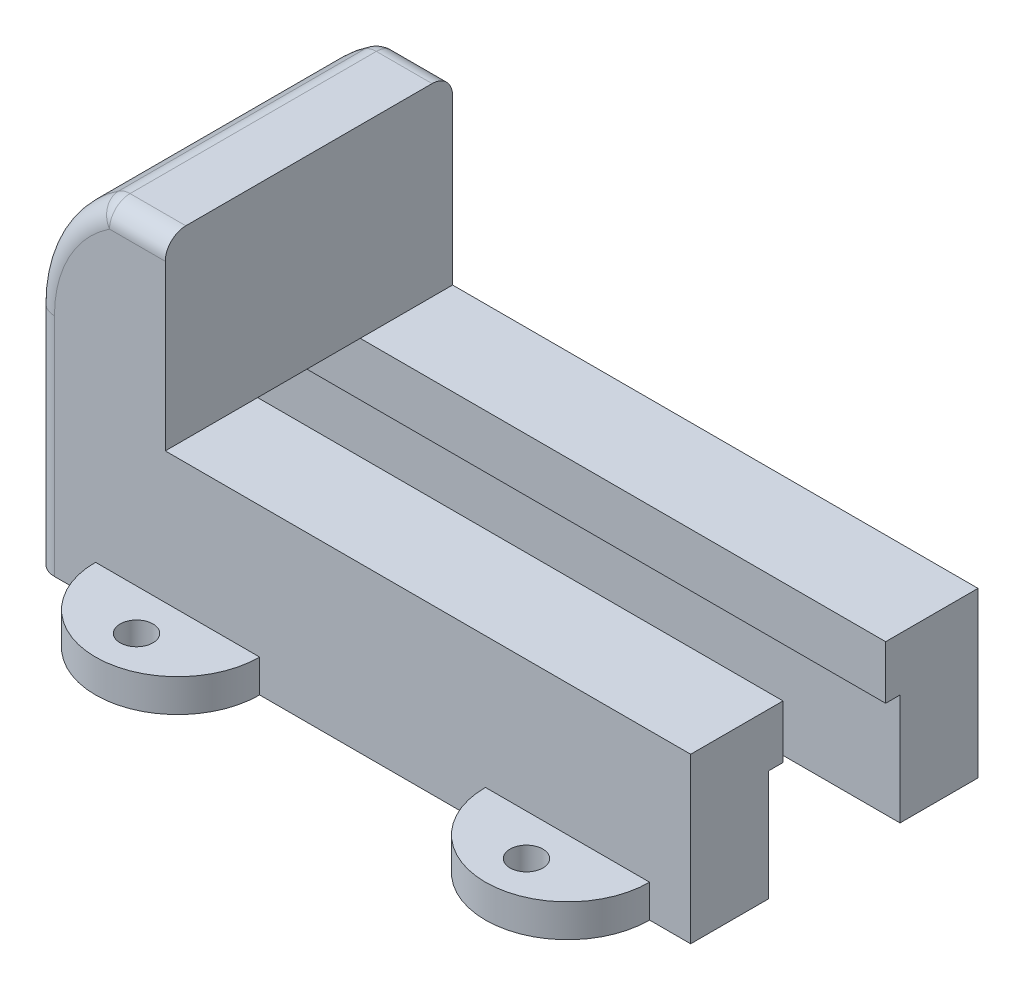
ISO-10303-21;
HEADER;
FILE_DESCRIPTION(('STEP AP214'),'2;1');
FILE_NAME('part.step','',(''),(''),'','','');
FILE_SCHEMA(('AUTOMOTIVE_DESIGN { 1 0 10303 214 1 1 1 1 }'));
ENDSEC;
DATA;
#1=APPLICATION_CONTEXT('core data for automotive mechanical design processes');
#2=APPLICATION_PROTOCOL_DEFINITION('international standard','automotive_design',2000,#1);
#3=PRODUCT_CONTEXT('',#1,'mechanical');
#4=PRODUCT('Part','Part','',(#3));
#5=PRODUCT_RELATED_PRODUCT_CATEGORY('part','',(#4));
#6=PRODUCT_DEFINITION_FORMATION('','',#4);
#7=PRODUCT_DEFINITION_CONTEXT('part definition',#1,'design');
#8=PRODUCT_DEFINITION('design','',#6,#7);
#9=PRODUCT_DEFINITION_SHAPE('','',#8);
#10=(LENGTH_UNIT() NAMED_UNIT(*) SI_UNIT(.MILLI.,.METRE.));
#11=(NAMED_UNIT(*) PLANE_ANGLE_UNIT() SI_UNIT($,.RADIAN.));
#12=(NAMED_UNIT(*) SI_UNIT($,.STERADIAN.) SOLID_ANGLE_UNIT());
#13=UNCERTAINTY_MEASURE_WITH_UNIT(LENGTH_MEASURE(1.E-05),#10,'distance_accuracy_value','');
#14=(GEOMETRIC_REPRESENTATION_CONTEXT(3) GLOBAL_UNCERTAINTY_ASSIGNED_CONTEXT((#13)) GLOBAL_UNIT_ASSIGNED_CONTEXT((#10,
#11,#12)) REPRESENTATION_CONTEXT('',''));
#15=CARTESIAN_POINT('',(0.,0.,0.));
#16=DIRECTION('',(0.,0.,1.));
#17=DIRECTION('',(1.,0.,0.));
#18=AXIS2_PLACEMENT_3D('',#15,#16,#17);
#19=CARTESIAN_POINT('',(0.,40.,-35.));
#20=DIRECTION('',(0.,0.,-1.));
#21=DIRECTION('',(-1.,0.,0.));
#22=AXIS2_PLACEMENT_3D('',#19,#20,#21);
#23=PLANE('',#22);
#24=DIRECTION('',(-1.,0.,0.));
#25=VECTOR('',#24,1.);
#26=CARTESIAN_POINT('',(0.,40.,-35.));
#27=LINE('',#26,#25);
#28=CARTESIAN_POINT('',(160.,40.,-35.));
#29=VERTEX_POINT('',#28);
#30=CARTESIAN_POINT('',(32.,40.,-35.));
#31=VERTEX_POINT('',#30);
#32=EDGE_CURVE('E494',#29,#31,#27,.T.);
#33=ORIENTED_EDGE('',*,*,#32,.F.);
#34=DIRECTION('',(0.,-1.,0.));
#35=VECTOR('',#34,1.);
#36=CARTESIAN_POINT('',(160.,40.,-35.));
#37=LINE('',#36,#35);
#38=CARTESIAN_POINT('',(160.,0.,-35.));
#39=VERTEX_POINT('',#38);
#40=EDGE_CURVE('E49',#29,#39,#37,.T.);
#41=ORIENTED_EDGE('',*,*,#40,.T.);
#42=DIRECTION('',(1.,0.,0.));
#43=VECTOR('',#42,1.);
#44=CARTESIAN_POINT('',(0.,0.,-35.));
#45=LINE('',#44,#43);
#46=CARTESIAN_POINT('',(150.,0.,-35.));
#47=VERTEX_POINT('',#46);
#48=EDGE_CURVE('E399',#47,#39,#45,.T.);
#49=ORIENTED_EDGE('',*,*,#48,.F.);
#50=DIRECTION('',(0.,-1.,0.));
#51=VECTOR('',#50,1.);
#52=CARTESIAN_POINT('',(150.,52.7213595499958,-35.));
#53=LINE('',#52,#51);
#54=CARTESIAN_POINT('',(150.,8.,-35.));
#55=VERTEX_POINT('',#54);
#56=EDGE_CURVE('E301',#55,#47,#53,.T.);
#57=ORIENTED_EDGE('',*,*,#56,.F.);
#58=DIRECTION('',(1.,0.,0.));
#59=VECTOR('',#58,1.);
#60=CARTESIAN_POINT('',(110.,8.,-35.));
#61=LINE('',#60,#59);
#62=CARTESIAN_POINT('',(110.,8.,-35.));
#63=VERTEX_POINT('',#62);
#64=EDGE_CURVE('E309',#63,#55,#61,.T.);
#65=ORIENTED_EDGE('',*,*,#64,.F.);
#66=DIRECTION('',(0.,-1.,0.));
#67=VECTOR('',#66,1.);
#68=CARTESIAN_POINT('',(110.,52.7213595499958,-35.));
#69=LINE('',#68,#67);
#70=CARTESIAN_POINT('',(110.,0.,-35.));
#71=VERTEX_POINT('',#70);
#72=EDGE_CURVE('E304',#63,#71,#69,.T.);
#73=ORIENTED_EDGE('',*,*,#72,.T.);
#74=CARTESIAN_POINT('',(55.,0.,-35.));
#75=VERTEX_POINT('',#74);
#76=EDGE_CURVE('E499',#75,#71,#45,.T.);
#77=ORIENTED_EDGE('',*,*,#76,.F.);
#78=DIRECTION('',(0.,-1.,0.));
#79=VECTOR('',#78,1.);
#80=CARTESIAN_POINT('',(55.,8.,-35.));
#81=LINE('',#80,#79);
#82=CARTESIAN_POINT('',(55.,8.,-35.));
#83=VERTEX_POINT('',#82);
#84=EDGE_CURVE('E320',#83,#75,#81,.T.);
#85=ORIENTED_EDGE('',*,*,#84,.F.);
#86=DIRECTION('',(1.,0.,0.));
#87=VECTOR('',#86,1.);
#88=CARTESIAN_POINT('',(15.,8.,-35.));
#89=LINE('',#88,#87);
#90=CARTESIAN_POINT('',(15.,8.,-35.));
#91=VERTEX_POINT('',#90);
#92=EDGE_CURVE('E318',#91,#83,#89,.T.);
#93=ORIENTED_EDGE('',*,*,#92,.F.);
#94=DIRECTION('',(0.,-1.,0.));
#95=VECTOR('',#94,1.);
#96=CARTESIAN_POINT('',(15.,8.,-35.));
#97=LINE('',#96,#95);
#98=CARTESIAN_POINT('',(15.,0.,-35.));
#99=VERTEX_POINT('',#98);
#100=EDGE_CURVE('E323',#91,#99,#97,.T.);
#101=ORIENTED_EDGE('',*,*,#100,.T.);
#102=CARTESIAN_POINT('',(5.,0.,-35.));
#103=VERTEX_POINT('',#102);
#104=EDGE_CURVE('E495',#103,#99,#45,.T.);
#105=ORIENTED_EDGE('',*,*,#104,.F.);
#106=DIRECTION('',(0.,-1.,0.));
#107=VECTOR('',#106,1.);
#108=CARTESIAN_POINT('',(5.,55.,-35.));
#109=LINE('',#108,#107);
#110=CARTESIAN_POINT('',(5.,55.,-35.));
#111=VERTEX_POINT('',#110);
#112=EDGE_CURVE('E426',#103,#111,#109,.F.);
#113=ORIENTED_EDGE('',*,*,#112,.T.);
#114=CARTESIAN_POINT('',(35.,55.,-35.));
#115=DIRECTION('',(0.,0.,-1.));
#116=DIRECTION('',(-1.,0.,0.));
#117=AXIS2_PLACEMENT_3D('',#114,#115,#116);
#118=CIRCLE('',#117,30.);
#119=CARTESIAN_POINT('',(18.416876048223,80.,-35.));
#120=VERTEX_POINT('',#119);
#121=EDGE_CURVE('E428',#111,#120,#118,.T.);
#122=ORIENTED_EDGE('',*,*,#121,.T.);
#123=DIRECTION('',(-1.,0.,0.));
#124=VECTOR('',#123,1.);
#125=CARTESIAN_POINT('',(0.,80.,-35.));
#126=LINE('',#125,#124);
#127=CARTESIAN_POINT('',(32.,80.,-35.));
#128=VERTEX_POINT('',#127);
#129=EDGE_CURVE('E430',#120,#128,#126,.F.);
#130=ORIENTED_EDGE('',*,*,#129,.T.);
#131=DIRECTION('',(0.,1.,0.));
#132=VECTOR('',#131,1.);
#133=CARTESIAN_POINT('',(32.,40.,-35.));
#134=LINE('',#133,#132);
#135=EDGE_CURVE('E416',#31,#128,#134,.T.);
#136=ORIENTED_EDGE('',*,*,#135,.F.);
#137=EDGE_LOOP('',(#33,#41,#49,#57,#65,#73,#77,#85,#93,#101,#105,#113,#122,#130,#136));
#138=FACE_BOUND('',#137,.T.);
#139=ADVANCED_FACE('F32',(#138),#23,.T.);
#140=CARTESIAN_POINT('',(0.,0.,35.));
#141=DIRECTION('',(0.,1.,0.));
#142=DIRECTION('',(0.,0.,1.));
#143=AXIS2_PLACEMENT_3D('',#140,#141,#142);
#144=PLANE('',#143);
#145=CARTESIAN_POINT('',(130.,0.,-45.));
#146=DIRECTION('',(0.,1.,0.));
#147=DIRECTION('',(0.,0.,1.));
#148=AXIS2_PLACEMENT_3D('',#145,#146,#147);
#149=CIRCLE('',#148,4.);
#150=CARTESIAN_POINT('',(130.,0.,-41.));
#151=VERTEX_POINT('',#150);
#152=EDGE_CURVE('E295',#151,#151,#149,.T.);
#153=ORIENTED_EDGE('',*,*,#152,.T.);
#154=EDGE_LOOP('',(#153));
#155=FACE_BOUND('',#154,.T.);
#156=CARTESIAN_POINT('',(35.,0.,-45.));
#157=DIRECTION('',(0.,1.,0.));
#158=DIRECTION('',(0.,0.,1.));
#159=AXIS2_PLACEMENT_3D('',#156,#157,#158);
#160=CIRCLE('',#159,4.);
#161=CARTESIAN_POINT('',(35.,0.,-41.));
#162=VERTEX_POINT('',#161);
#163=EDGE_CURVE('E289',#162,#162,#160,.T.);
#164=ORIENTED_EDGE('',*,*,#163,.T.);
#165=EDGE_LOOP('',(#164));
#166=FACE_BOUND('',#165,.T.);
#167=DIRECTION('',(0.,0.,-1.));
#168=VECTOR('',#167,1.);
#169=CARTESIAN_POINT('',(160.,0.,35.));
#170=LINE('',#169,#168);
#171=CARTESIAN_POINT('',(160.,0.,-16.));
#172=VERTEX_POINT('',#171);
#173=EDGE_CURVE('E272',#172,#39,#170,.T.);
#174=ORIENTED_EDGE('',*,*,#173,.F.);
#175=DIRECTION('',(1.,0.,0.));
#176=VECTOR('',#175,1.);
#177=CARTESIAN_POINT('',(0.,0.,-16.));
#178=LINE('',#177,#176);
#179=CARTESIAN_POINT('',(0.,0.,-16.));
#180=VERTEX_POINT('',#179);
#181=EDGE_CURVE('E384',#180,#172,#178,.T.);
#182=ORIENTED_EDGE('',*,*,#181,.F.);
#183=DIRECTION('',(0.,0.,-1.));
#184=VECTOR('',#183,1.);
#185=CARTESIAN_POINT('',(0.,0.,35.));
#186=LINE('',#185,#184);
#187=CARTESIAN_POINT('',(0.,0.,-30.));
#188=VERTEX_POINT('',#187);
#189=EDGE_CURVE('E492',#180,#188,#186,.T.);
#190=ORIENTED_EDGE('',*,*,#189,.T.);
#191=CARTESIAN_POINT('',(5.,0.,-30.));
#192=DIRECTION('',(0.,1.,0.));
#193=DIRECTION('',(0.,0.,1.));
#194=AXIS2_PLACEMENT_3D('',#191,#192,#193);
#195=CIRCLE('',#194,5.);
#196=EDGE_CURVE('E41',#188,#103,#195,.F.);
#197=ORIENTED_EDGE('',*,*,#196,.T.);
#198=ORIENTED_EDGE('',*,*,#104,.T.);
#199=CARTESIAN_POINT('',(35.,0.,-35.));
#200=DIRECTION('',(0.,1.,0.));
#201=DIRECTION('',(0.,0.,-1.));
#202=AXIS2_PLACEMENT_3D('',#199,#200,#201);
#203=CIRCLE('',#202,20.);
#204=EDGE_CURVE('E308',#75,#99,#203,.T.);
#205=ORIENTED_EDGE('',*,*,#204,.F.);
#206=ORIENTED_EDGE('',*,*,#76,.T.);
#207=CARTESIAN_POINT('',(130.,0.,-35.));
#208=DIRECTION('',(0.,1.,0.));
#209=DIRECTION('',(0.,0.,-1.));
#210=AXIS2_PLACEMENT_3D('',#207,#208,#209);
#211=CIRCLE('',#210,20.);
#212=EDGE_CURVE('E302',#47,#71,#211,.T.);
#213=ORIENTED_EDGE('',*,*,#212,.F.);
#214=ORIENTED_EDGE('',*,*,#48,.T.);
#215=EDGE_LOOP('',(#174,#182,#190,#197,#198,#205,#206,#213,#214));
#216=FACE_BOUND('',#215,.T.);
#217=ADVANCED_FACE('F543',(#155,#166,#216),#144,.F.);
#218=CARTESIAN_POINT('',(130.,0.,45.));
#219=DIRECTION('',(0.,1.,0.));
#220=DIRECTION('',(0.,0.,1.));
#221=AXIS2_PLACEMENT_3D('',#218,#219,#220);
#222=CIRCLE('',#221,4.);
#223=CARTESIAN_POINT('',(130.,0.,49.));
#224=VERTEX_POINT('',#223);
#225=EDGE_CURVE('E283',#224,#224,#222,.T.);
#226=ORIENTED_EDGE('',*,*,#225,.T.);
#227=EDGE_LOOP('',(#226));
#228=FACE_BOUND('',#227,.T.);
#229=CARTESIAN_POINT('',(35.,0.,45.));
#230=DIRECTION('',(0.,1.,0.));
#231=DIRECTION('',(0.,0.,1.));
#232=AXIS2_PLACEMENT_3D('',#229,#230,#231);
#233=CIRCLE('',#232,4.);
#234=CARTESIAN_POINT('',(35.,0.,49.));
#235=VERTEX_POINT('',#234);
#236=EDGE_CURVE('E277',#235,#235,#233,.T.);
#237=ORIENTED_EDGE('',*,*,#236,.T.);
#238=EDGE_LOOP('',(#237));
#239=FACE_BOUND('',#238,.T.);
#240=DIRECTION('',(0.,0.,-1.));
#241=VECTOR('',#240,1.);
#242=CARTESIAN_POINT('',(160.,0.,35.));
#243=LINE('',#242,#241);
#244=CARTESIAN_POINT('',(160.,0.,35.));
#245=VERTEX_POINT('',#244);
#246=CARTESIAN_POINT('',(160.,0.,16.));
#247=VERTEX_POINT('',#246);
#248=EDGE_CURVE('E57',#245,#247,#243,.T.);
#249=ORIENTED_EDGE('',*,*,#248,.F.);
#250=DIRECTION('',(1.,0.,0.));
#251=VECTOR('',#250,1.);
#252=CARTESIAN_POINT('',(0.,0.,35.));
#253=LINE('',#252,#251);
#254=CARTESIAN_POINT('',(150.,0.,35.));
#255=VERTEX_POINT('',#254);
#256=EDGE_CURVE('E491',#255,#245,#253,.T.);
#257=ORIENTED_EDGE('',*,*,#256,.F.);
#258=CARTESIAN_POINT('',(130.,0.,35.));
#259=DIRECTION('',(0.,-1.,0.));
#260=DIRECTION('',(0.,0.,1.));
#261=AXIS2_PLACEMENT_3D('',#258,#259,#260);
#262=CIRCLE('',#261,20.);
#263=CARTESIAN_POINT('',(110.,0.,35.));
#264=VERTEX_POINT('',#263);
#265=EDGE_CURVE('E326',#255,#264,#262,.T.);
#266=ORIENTED_EDGE('',*,*,#265,.T.);
#267=CARTESIAN_POINT('',(55.,0.,35.));
#268=VERTEX_POINT('',#267);
#269=EDGE_CURVE('E490',#268,#264,#253,.T.);
#270=ORIENTED_EDGE('',*,*,#269,.F.);
#271=CARTESIAN_POINT('',(35.,0.,35.));
#272=DIRECTION('',(0.,-1.,0.));
#273=DIRECTION('',(0.,0.,1.));
#274=AXIS2_PLACEMENT_3D('',#271,#272,#273);
#275=CIRCLE('',#274,20.);
#276=CARTESIAN_POINT('',(15.,0.,35.));
#277=VERTEX_POINT('',#276);
#278=EDGE_CURVE('E341',#268,#277,#275,.T.);
#279=ORIENTED_EDGE('',*,*,#278,.T.);
#280=CARTESIAN_POINT('',(5.,0.,35.));
#281=VERTEX_POINT('',#280);
#282=EDGE_CURVE('E406',#281,#277,#253,.T.);
#283=ORIENTED_EDGE('',*,*,#282,.F.);
#284=CARTESIAN_POINT('',(5.,0.,30.));
#285=DIRECTION('',(0.,1.,0.));
#286=DIRECTION('',(0.,0.,1.));
#287=AXIS2_PLACEMENT_3D('',#284,#285,#286);
#288=CIRCLE('',#287,5.);
#289=CARTESIAN_POINT('',(0.,0.,30.));
#290=VERTEX_POINT('',#289);
#291=EDGE_CURVE('E11',#281,#290,#288,.F.);
#292=ORIENTED_EDGE('',*,*,#291,.T.);
#293=CARTESIAN_POINT('',(0.,0.,16.));
#294=VERTEX_POINT('',#293);
#295=EDGE_CURVE('E421',#290,#294,#186,.T.);
#296=ORIENTED_EDGE('',*,*,#295,.T.);
#297=DIRECTION('',(1.,0.,0.));
#298=VECTOR('',#297,1.);
#299=CARTESIAN_POINT('',(0.,0.,16.));
#300=LINE('',#299,#298);
#301=EDGE_CURVE('E386',#294,#247,#300,.T.);
#302=ORIENTED_EDGE('',*,*,#301,.T.);
#303=EDGE_LOOP('',(#249,#257,#266,#270,#279,#283,#292,#296,#302));
#304=FACE_BOUND('',#303,.T.);
#305=ADVANCED_FACE('F487',(#228,#239,#304),#144,.F.);
#306=CARTESIAN_POINT('',(0.,40.,35.));
#307=DIRECTION('',(0.,0.,-1.));
#308=DIRECTION('',(-1.,0.,0.));
#309=AXIS2_PLACEMENT_3D('',#306,#307,#308);
#310=PLANE('',#309);
#311=DIRECTION('',(0.,-1.,0.));
#312=VECTOR('',#311,1.);
#313=CARTESIAN_POINT('',(160.,40.,35.));
#314=LINE('',#313,#312);
#315=CARTESIAN_POINT('',(160.,40.,35.));
#316=VERTEX_POINT('',#315);
#317=EDGE_CURVE('E261',#316,#245,#314,.T.);
#318=ORIENTED_EDGE('',*,*,#317,.F.);
#319=DIRECTION('',(-1.,0.,0.));
#320=VECTOR('',#319,1.);
#321=CARTESIAN_POINT('',(0.,40.,35.));
#322=LINE('',#321,#320);
#323=CARTESIAN_POINT('',(32.,40.,35.));
#324=VERTEX_POINT('',#323);
#325=EDGE_CURVE('E235',#316,#324,#322,.T.);
#326=ORIENTED_EDGE('',*,*,#325,.T.);
#327=DIRECTION('',(0.,1.,0.));
#328=VECTOR('',#327,1.);
#329=CARTESIAN_POINT('',(32.,40.,35.));
#330=LINE('',#329,#328);
#331=CARTESIAN_POINT('',(32.,80.,35.));
#332=VERTEX_POINT('',#331);
#333=EDGE_CURVE('E239',#324,#332,#330,.T.);
#334=ORIENTED_EDGE('',*,*,#333,.T.);
#335=DIRECTION('',(-1.,0.,0.));
#336=VECTOR('',#335,1.);
#337=CARTESIAN_POINT('',(16.97224362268,80.,35.));
#338=LINE('',#337,#336);
#339=CARTESIAN_POINT('',(18.416876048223,80.,35.));
#340=VERTEX_POINT('',#339);
#341=EDGE_CURVE('E436',#332,#340,#338,.T.);
#342=ORIENTED_EDGE('',*,*,#341,.T.);
#343=CARTESIAN_POINT('',(35.,55.,35.));
#344=DIRECTION('',(0.,0.,-1.));
#345=DIRECTION('',(-1.,0.,0.));
#346=AXIS2_PLACEMENT_3D('',#343,#344,#345);
#347=CIRCLE('',#346,30.);
#348=CARTESIAN_POINT('',(5.,55.,35.));
#349=VERTEX_POINT('',#348);
#350=EDGE_CURVE('E434',#340,#349,#347,.F.);
#351=ORIENTED_EDGE('',*,*,#350,.T.);
#352=DIRECTION('',(0.,-1.,0.));
#353=VECTOR('',#352,1.);
#354=CARTESIAN_POINT('',(5.,40.,35.));
#355=LINE('',#354,#353);
#356=EDGE_CURVE('E432',#349,#281,#355,.T.);
#357=ORIENTED_EDGE('',*,*,#356,.T.);
#358=ORIENTED_EDGE('',*,*,#282,.T.);
#359=DIRECTION('',(0.,-1.,0.));
#360=VECTOR('',#359,1.);
#361=CARTESIAN_POINT('',(15.,8.,35.));
#362=LINE('',#361,#360);
#363=CARTESIAN_POINT('',(15.,8.,35.));
#364=VERTEX_POINT('',#363);
#365=EDGE_CURVE('E347',#364,#277,#362,.T.);
#366=ORIENTED_EDGE('',*,*,#365,.F.);
#367=DIRECTION('',(1.,0.,0.));
#368=VECTOR('',#367,1.);
#369=CARTESIAN_POINT('',(15.,8.,35.));
#370=LINE('',#369,#368);
#371=CARTESIAN_POINT('',(55.,8.,35.));
#372=VERTEX_POINT('',#371);
#373=EDGE_CURVE('E345',#364,#372,#370,.T.);
#374=ORIENTED_EDGE('',*,*,#373,.T.);
#375=DIRECTION('',(0.,-1.,0.));
#376=VECTOR('',#375,1.);
#377=CARTESIAN_POINT('',(55.,8.,35.));
#378=LINE('',#377,#376);
#379=EDGE_CURVE('E350',#372,#268,#378,.T.);
#380=ORIENTED_EDGE('',*,*,#379,.T.);
#381=ORIENTED_EDGE('',*,*,#269,.T.);
#382=DIRECTION('',(0.,-1.,0.));
#383=VECTOR('',#382,1.);
#384=CARTESIAN_POINT('',(110.,52.7213595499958,35.));
#385=LINE('',#384,#383);
#386=CARTESIAN_POINT('',(110.,8.,35.));
#387=VERTEX_POINT('',#386);
#388=EDGE_CURVE('E337',#387,#264,#385,.T.);
#389=ORIENTED_EDGE('',*,*,#388,.F.);
#390=DIRECTION('',(1.,0.,0.));
#391=VECTOR('',#390,1.);
#392=CARTESIAN_POINT('',(110.,8.,35.));
#393=LINE('',#392,#391);
#394=CARTESIAN_POINT('',(150.,8.,35.));
#395=VERTEX_POINT('',#394);
#396=EDGE_CURVE('E331',#387,#395,#393,.T.);
#397=ORIENTED_EDGE('',*,*,#396,.T.);
#398=DIRECTION('',(0.,-1.,0.));
#399=VECTOR('',#398,1.);
#400=CARTESIAN_POINT('',(150.,52.7213595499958,35.));
#401=LINE('',#400,#399);
#402=EDGE_CURVE('E334',#395,#255,#401,.T.);
#403=ORIENTED_EDGE('',*,*,#402,.T.);
#404=ORIENTED_EDGE('',*,*,#256,.T.);
#405=EDGE_LOOP('',(#318,#326,#334,#342,#351,#357,#358,#366,#374,#380,#381,#389,#397,#403,#404));
#406=FACE_BOUND('',#405,.T.);
#407=ADVANCED_FACE('F486',(#406),#310,.F.);
#408=CARTESIAN_POINT('',(0.,27.,-12.5));
#409=DIRECTION('',(0.,0.,-1.));
#410=DIRECTION('',(-1.,0.,0.));
#411=AXIS2_PLACEMENT_3D('',#408,#409,#410);
#412=PLANE('',#411);
#413=DIRECTION('',(0.,-1.,0.));
#414=VECTOR('',#413,1.);
#415=CARTESIAN_POINT('',(160.,27.,-12.5));
#416=LINE('',#415,#414);
#417=CARTESIAN_POINT('',(160.,40.,-12.5));
#418=VERTEX_POINT('',#417);
#419=CARTESIAN_POINT('',(160.,27.,-12.5));
#420=VERTEX_POINT('',#419);
#421=EDGE_CURVE('E269',#418,#420,#416,.T.);
#422=ORIENTED_EDGE('',*,*,#421,.F.);
#423=DIRECTION('',(1.,0.,0.));
#424=VECTOR('',#423,1.);
#425=CARTESIAN_POINT('',(0.,40.,-12.5));
#426=LINE('',#425,#424);
#427=CARTESIAN_POINT('',(32.,40.,-12.5));
#428=VERTEX_POINT('',#427);
#429=EDGE_CURVE('E376',#428,#418,#426,.T.);
#430=ORIENTED_EDGE('',*,*,#429,.F.);
#431=CARTESIAN_POINT('',(0.,40.,-12.5));
#432=VERTEX_POINT('',#431);
#433=EDGE_CURVE('E249',#432,#428,#426,.T.);
#434=ORIENTED_EDGE('',*,*,#433,.F.);
#435=DIRECTION('',(0.,1.,0.));
#436=VECTOR('',#435,1.);
#437=CARTESIAN_POINT('',(0.,27.,-12.5));
#438=LINE('',#437,#436);
#439=CARTESIAN_POINT('',(0.,27.,-12.5));
#440=VERTEX_POINT('',#439);
#441=EDGE_CURVE('E353',#440,#432,#438,.T.);
#442=ORIENTED_EDGE('',*,*,#441,.F.);
#443=DIRECTION('',(1.,0.,0.));
#444=VECTOR('',#443,1.);
#445=CARTESIAN_POINT('',(0.,27.,-12.5));
#446=LINE('',#445,#444);
#447=EDGE_CURVE('E377',#440,#420,#446,.T.);
#448=ORIENTED_EDGE('',*,*,#447,.T.);
#449=EDGE_LOOP('',(#422,#430,#434,#442,#448));
#450=FACE_BOUND('',#449,.T.);
#451=ADVANCED_FACE('F640',(#450),#412,.F.);
#452=CARTESIAN_POINT('',(0.,27.,-12.5));
#453=DIRECTION('',(0.,1.,0.));
#454=DIRECTION('',(0.,0.,1.));
#455=AXIS2_PLACEMENT_3D('',#452,#453,#454);
#456=PLANE('',#455);
#457=DIRECTION('',(0.,0.,-1.));
#458=VECTOR('',#457,1.);
#459=CARTESIAN_POINT('',(160.,27.,-12.5));
#460=LINE('',#459,#458);
#461=CARTESIAN_POINT('',(160.,27.,-16.));
#462=VERTEX_POINT('',#461);
#463=EDGE_CURVE('E266',#420,#462,#460,.T.);
#464=ORIENTED_EDGE('',*,*,#463,.F.);
#465=ORIENTED_EDGE('',*,*,#447,.F.);
#466=DIRECTION('',(0.,0.,1.));
#467=VECTOR('',#466,1.);
#468=CARTESIAN_POINT('',(0.,27.,-12.5));
#469=LINE('',#468,#467);
#470=CARTESIAN_POINT('',(0.,27.,-16.));
#471=VERTEX_POINT('',#470);
#472=EDGE_CURVE('E373',#471,#440,#469,.T.);
#473=ORIENTED_EDGE('',*,*,#472,.F.);
#474=DIRECTION('',(1.,0.,0.));
#475=VECTOR('',#474,1.);
#476=CARTESIAN_POINT('',(0.,27.,-16.));
#477=LINE('',#476,#475);
#478=EDGE_CURVE('E381',#471,#462,#477,.T.);
#479=ORIENTED_EDGE('',*,*,#478,.T.);
#480=EDGE_LOOP('',(#464,#465,#473,#479));
#481=FACE_BOUND('',#480,.T.);
#482=ADVANCED_FACE('F650',(#481),#456,.F.);
#483=CARTESIAN_POINT('',(0.,27.,-16.));
#484=DIRECTION('',(0.,0.,-1.));
#485=DIRECTION('',(0.,1.,0.));
#486=AXIS2_PLACEMENT_3D('',#483,#484,#485);
#487=PLANE('',#486);
#488=DIRECTION('',(0.,-1.,0.));
#489=VECTOR('',#488,1.);
#490=CARTESIAN_POINT('',(160.,27.,-16.));
#491=LINE('',#490,#489);
#492=EDGE_CURVE('E263',#462,#172,#491,.T.);
#493=ORIENTED_EDGE('',*,*,#492,.F.);
#494=ORIENTED_EDGE('',*,*,#478,.F.);
#495=DIRECTION('',(0.,1.,0.));
#496=VECTOR('',#495,1.);
#497=CARTESIAN_POINT('',(0.,27.,-16.));
#498=LINE('',#497,#496);
#499=EDGE_CURVE('E370',#180,#471,#498,.T.);
#500=ORIENTED_EDGE('',*,*,#499,.F.);
#501=ORIENTED_EDGE('',*,*,#181,.T.);
#502=EDGE_LOOP('',(#493,#494,#500,#501));
#503=FACE_BOUND('',#502,.T.);
#504=ADVANCED_FACE('F661',(#503),#487,.F.);
#505=CARTESIAN_POINT('',(0.,0.,16.));
#506=DIRECTION('',(0.,0.,1.));
#507=DIRECTION('',(0.,-1.,0.));
#508=AXIS2_PLACEMENT_3D('',#505,#506,#507);
#509=PLANE('',#508);
#510=DIRECTION('',(0.,1.,0.));
#511=VECTOR('',#510,1.);
#512=CARTESIAN_POINT('',(160.,0.,16.));
#513=LINE('',#512,#511);
#514=CARTESIAN_POINT('',(160.,27.,16.));
#515=VERTEX_POINT('',#514);
#516=EDGE_CURVE('E256',#247,#515,#513,.T.);
#517=ORIENTED_EDGE('',*,*,#516,.F.);
#518=ORIENTED_EDGE('',*,*,#301,.F.);
#519=DIRECTION('',(0.,-1.,0.));
#520=VECTOR('',#519,1.);
#521=CARTESIAN_POINT('',(0.,0.,16.));
#522=LINE('',#521,#520);
#523=CARTESIAN_POINT('',(0.,27.,16.));
#524=VERTEX_POINT('',#523);
#525=EDGE_CURVE('E367',#524,#294,#522,.T.);
#526=ORIENTED_EDGE('',*,*,#525,.F.);
#527=DIRECTION('',(1.,0.,0.));
#528=VECTOR('',#527,1.);
#529=CARTESIAN_POINT('',(0.,27.,16.));
#530=LINE('',#529,#528);
#531=EDGE_CURVE('E388',#524,#515,#530,.T.);
#532=ORIENTED_EDGE('',*,*,#531,.T.);
#533=EDGE_LOOP('',(#517,#518,#526,#532));
#534=FACE_BOUND('',#533,.T.);
#535=ADVANCED_FACE('F671',(#534),#509,.F.);
#536=CARTESIAN_POINT('',(0.,27.,16.));
#537=DIRECTION('',(0.,1.,0.));
#538=DIRECTION('',(0.,0.,1.));
#539=AXIS2_PLACEMENT_3D('',#536,#537,#538);
#540=PLANE('',#539);
#541=DIRECTION('',(0.,0.,-1.));
#542=VECTOR('',#541,1.);
#543=CARTESIAN_POINT('',(160.,27.,16.));
#544=LINE('',#543,#542);
#545=CARTESIAN_POINT('',(160.,27.,12.5));
#546=VERTEX_POINT('',#545);
#547=EDGE_CURVE('E254',#515,#546,#544,.T.);
#548=ORIENTED_EDGE('',*,*,#547,.F.);
#549=ORIENTED_EDGE('',*,*,#531,.F.);
#550=DIRECTION('',(0.,0.,1.));
#551=VECTOR('',#550,1.);
#552=CARTESIAN_POINT('',(0.,27.,16.));
#553=LINE('',#552,#551);
#554=CARTESIAN_POINT('',(0.,27.,12.5));
#555=VERTEX_POINT('',#554);
#556=EDGE_CURVE('E364',#555,#524,#553,.T.);
#557=ORIENTED_EDGE('',*,*,#556,.F.);
#558=DIRECTION('',(1.,0.,0.));
#559=VECTOR('',#558,1.);
#560=CARTESIAN_POINT('',(0.,27.,12.5));
#561=LINE('',#560,#559);
#562=EDGE_CURVE('E391',#555,#546,#561,.T.);
#563=ORIENTED_EDGE('',*,*,#562,.T.);
#564=EDGE_LOOP('',(#548,#549,#557,#563));
#565=FACE_BOUND('',#564,.T.);
#566=ADVANCED_FACE('F681',(#565),#540,.F.);
#567=CARTESIAN_POINT('',(0.,27.,12.5));
#568=DIRECTION('',(0.,0.,1.));
#569=DIRECTION('',(1.,0.,0.));
#570=AXIS2_PLACEMENT_3D('',#567,#568,#569);
#571=PLANE('',#570);
#572=DIRECTION('',(0.,1.,0.));
#573=VECTOR('',#572,1.);
#574=CARTESIAN_POINT('',(160.,27.,12.5));
#575=LINE('',#574,#573);
#576=CARTESIAN_POINT('',(160.,40.,12.5));
#577=VERTEX_POINT('',#576);
#578=EDGE_CURVE('E245',#546,#577,#575,.T.);
#579=ORIENTED_EDGE('',*,*,#578,.F.);
#580=ORIENTED_EDGE('',*,*,#562,.F.);
#581=DIRECTION('',(0.,-1.,0.));
#582=VECTOR('',#581,1.);
#583=CARTESIAN_POINT('',(0.,27.,12.5));
#584=LINE('',#583,#582);
#585=CARTESIAN_POINT('',(0.,40.,12.5));
#586=VERTEX_POINT('',#585);
#587=EDGE_CURVE('E361',#586,#555,#584,.T.);
#588=ORIENTED_EDGE('',*,*,#587,.F.);
#589=DIRECTION('',(1.,0.,0.));
#590=VECTOR('',#589,1.);
#591=CARTESIAN_POINT('',(0.,40.,12.5));
#592=LINE('',#591,#590);
#593=CARTESIAN_POINT('',(32.,40.,12.5));
#594=VERTEX_POINT('',#593);
#595=EDGE_CURVE('E248',#586,#594,#592,.T.);
#596=ORIENTED_EDGE('',*,*,#595,.T.);
#597=EDGE_CURVE('E232',#594,#577,#592,.T.);
#598=ORIENTED_EDGE('',*,*,#597,.T.);
#599=EDGE_LOOP('',(#579,#580,#588,#596,#598));
#600=FACE_BOUND('',#599,.T.);
#601=ADVANCED_FACE('F244',(#600),#571,.F.);
#602=CARTESIAN_POINT('',(0.,40.,35.));
#603=DIRECTION('',(0.,-1.,0.));
#604=DIRECTION('',(0.,0.,-1.));
#605=AXIS2_PLACEMENT_3D('',#602,#603,#604);
#606=PLANE('',#605);
#607=DIRECTION('',(0.,0.,1.));
#608=VECTOR('',#607,1.);
#609=CARTESIAN_POINT('',(32.,40.,-35.));
#610=LINE('',#609,#608);
#611=EDGE_CURVE('E403',#31,#428,#610,.T.);
#612=ORIENTED_EDGE('',*,*,#611,.T.);
#613=ORIENTED_EDGE('',*,*,#429,.T.);
#614=DIRECTION('',(0.,0.,-1.));
#615=VECTOR('',#614,1.);
#616=CARTESIAN_POINT('',(160.,40.,35.));
#617=LINE('',#616,#615);
#618=EDGE_CURVE('E240',#418,#29,#617,.T.);
#619=ORIENTED_EDGE('',*,*,#618,.T.);
#620=ORIENTED_EDGE('',*,*,#32,.T.);
#621=EDGE_LOOP('',(#612,#613,#619,#620));
#622=FACE_BOUND('',#621,.T.);
#623=ADVANCED_FACE('F555',(#622),#606,.F.);
#624=EDGE_CURVE('E229',#316,#577,#617,.T.);
#625=ORIENTED_EDGE('',*,*,#624,.T.);
#626=ORIENTED_EDGE('',*,*,#597,.F.);
#627=EDGE_CURVE('E413',#594,#324,#610,.T.);
#628=ORIENTED_EDGE('',*,*,#627,.T.);
#629=ORIENTED_EDGE('',*,*,#325,.F.);
#630=EDGE_LOOP('',(#625,#626,#628,#629));
#631=FACE_BOUND('',#630,.T.);
#632=ADVANCED_FACE('F231',(#631),#606,.F.);
#633=CARTESIAN_POINT('',(0.,0.,35.));
#634=DIRECTION('',(1.,0.,0.));
#635=DIRECTION('',(0.,0.,-1.));
#636=AXIS2_PLACEMENT_3D('',#633,#634,#635);
#637=PLANE('',#636);
#638=DIRECTION('',(0.,0.,1.));
#639=VECTOR('',#638,1.);
#640=CARTESIAN_POINT('',(0.,55.,-35.));
#641=LINE('',#640,#639);
#642=CARTESIAN_POINT('',(0.,55.,-30.));
#643=VERTEX_POINT('',#642);
#644=CARTESIAN_POINT('',(0.,55.,30.));
#645=VERTEX_POINT('',#644);
#646=EDGE_CURVE('E396',#643,#645,#641,.T.);
#647=ORIENTED_EDGE('',*,*,#646,.F.);
#648=DIRECTION('',(0.,-1.,0.));
#649=VECTOR('',#648,1.);
#650=CARTESIAN_POINT('',(0.,0.,-30.));
#651=LINE('',#650,#649);
#652=EDGE_CURVE('E450',#643,#188,#651,.T.);
#653=ORIENTED_EDGE('',*,*,#652,.T.);
#654=ORIENTED_EDGE('',*,*,#189,.F.);
#655=ORIENTED_EDGE('',*,*,#499,.T.);
#656=ORIENTED_EDGE('',*,*,#472,.T.);
#657=ORIENTED_EDGE('',*,*,#441,.T.);
#658=DIRECTION('',(0.,0.,1.));
#659=VECTOR('',#658,1.);
#660=CARTESIAN_POINT('',(0.,40.,12.5));
#661=LINE('',#660,#659);
#662=EDGE_CURVE('E358',#432,#586,#661,.T.);
#663=ORIENTED_EDGE('',*,*,#662,.T.);
#664=ORIENTED_EDGE('',*,*,#587,.T.);
#665=ORIENTED_EDGE('',*,*,#556,.T.);
#666=ORIENTED_EDGE('',*,*,#525,.T.);
#667=ORIENTED_EDGE('',*,*,#295,.F.);
#668=DIRECTION('',(0.,-1.,0.));
#669=VECTOR('',#668,1.);
#670=CARTESIAN_POINT('',(0.,0.,30.));
#671=LINE('',#670,#669);
#672=EDGE_CURVE('E448',#290,#645,#671,.F.);
#673=ORIENTED_EDGE('',*,*,#672,.T.);
#674=EDGE_LOOP('',(#647,#653,#654,#655,#656,#657,#663,#664,#665,#666,#667,#673));
#675=FACE_BOUND('',#674,.T.);
#676=ADVANCED_FACE('F554',(#675),#637,.F.);
#677=CARTESIAN_POINT('',(35.,55.,-35.));
#678=DIRECTION('',(0.,0.,1.));
#679=DIRECTION('',(1.,0.,0.));
#680=AXIS2_PLACEMENT_3D('',#677,#678,#679);
#681=CYLINDRICAL_SURFACE('',#680,35.);
#682=DIRECTION('',(0.,0.,1.));
#683=VECTOR('',#682,1.);
#684=CARTESIAN_POINT('',(15.6530220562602,84.1666666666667,-35.));
#685=LINE('',#684,#683);
#686=CARTESIAN_POINT('',(15.6530220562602,84.1666666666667,30.));
#687=VERTEX_POINT('',#686);
#688=CARTESIAN_POINT('',(15.6530220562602,84.1666666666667,-30.));
#689=VERTEX_POINT('',#688);
#690=EDGE_CURVE('E418',#687,#689,#685,.F.);
#691=ORIENTED_EDGE('',*,*,#690,.T.);
#692=CARTESIAN_POINT('',(35.,55.,-30.));
#693=DIRECTION('',(0.,0.,-1.));
#694=DIRECTION('',(-1.,0.,0.));
#695=AXIS2_PLACEMENT_3D('',#692,#693,#694);
#696=CIRCLE('',#695,35.);
#697=EDGE_CURVE('E423',#689,#643,#696,.F.);
#698=ORIENTED_EDGE('',*,*,#697,.T.);
#699=ORIENTED_EDGE('',*,*,#646,.T.);
#700=CARTESIAN_POINT('',(35.,55.,30.));
#701=DIRECTION('',(0.,0.,-1.));
#702=DIRECTION('',(-1.,0.,0.));
#703=AXIS2_PLACEMENT_3D('',#700,#701,#702);
#704=CIRCLE('',#703,35.);
#705=EDGE_CURVE('E420',#645,#687,#704,.T.);
#706=ORIENTED_EDGE('',*,*,#705,.T.);
#707=EDGE_LOOP('',(#691,#698,#699,#706));
#708=FACE_BOUND('',#707,.T.);
#709=ADVANCED_FACE('F559',(#708),#681,.T.);
#710=CARTESIAN_POINT('',(16.97224362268,85.,-35.));
#711=DIRECTION('',(0.,1.,0.));
#712=DIRECTION('',(0.,0.,1.));
#713=AXIS2_PLACEMENT_3D('',#710,#711,#712);
#714=PLANE('',#713);
#715=DIRECTION('',(0.,0.,1.));
#716=VECTOR('',#715,1.);
#717=CARTESIAN_POINT('',(32.,85.,-35.));
#718=LINE('',#717,#716);
#719=CARTESIAN_POINT('',(32.,85.,-30.));
#720=VERTEX_POINT('',#719);
#721=CARTESIAN_POINT('',(32.,85.,30.));
#722=VERTEX_POINT('',#721);
#723=EDGE_CURVE('E400',#720,#722,#718,.T.);
#724=ORIENTED_EDGE('',*,*,#723,.F.);
#725=DIRECTION('',(-1.,0.,0.));
#726=VECTOR('',#725,1.);
#727=CARTESIAN_POINT('',(16.97224362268,85.,-30.));
#728=LINE('',#727,#726);
#729=CARTESIAN_POINT('',(18.416876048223,85.,-30.));
#730=VERTEX_POINT('',#729);
#731=EDGE_CURVE('E442',#720,#730,#728,.T.);
#732=ORIENTED_EDGE('',*,*,#731,.T.);
#733=DIRECTION('',(0.,0.,1.));
#734=VECTOR('',#733,1.);
#735=CARTESIAN_POINT('',(18.416876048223,85.,-35.));
#736=LINE('',#735,#734);
#737=CARTESIAN_POINT('',(18.416876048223,85.,30.));
#738=VERTEX_POINT('',#737);
#739=EDGE_CURVE('E440',#730,#738,#736,.T.);
#740=ORIENTED_EDGE('',*,*,#739,.T.);
#741=DIRECTION('',(-1.,0.,0.));
#742=VECTOR('',#741,1.);
#743=CARTESIAN_POINT('',(32.,85.,30.));
#744=LINE('',#743,#742);
#745=EDGE_CURVE('E438',#738,#722,#744,.F.);
#746=ORIENTED_EDGE('',*,*,#745,.T.);
#747=EDGE_LOOP('',(#724,#732,#740,#746));
#748=FACE_BOUND('',#747,.T.);
#749=ADVANCED_FACE('F525',(#748),#714,.T.);
#750=CARTESIAN_POINT('',(32.,40.,-35.));
#751=DIRECTION('',(1.,0.,0.));
#752=DIRECTION('',(0.,0.,-1.));
#753=AXIS2_PLACEMENT_3D('',#750,#751,#752);
#754=PLANE('',#753);
#755=ORIENTED_EDGE('',*,*,#135,.T.);
#756=CARTESIAN_POINT('',(32.,80.,-30.));
#757=DIRECTION('',(1.,0.,0.));
#758=DIRECTION('',(0.,0.,-1.));
#759=AXIS2_PLACEMENT_3D('',#756,#757,#758);
#760=CIRCLE('',#759,5.);
#761=EDGE_CURVE('E446',#128,#720,#760,.T.);
#762=ORIENTED_EDGE('',*,*,#761,.T.);
#763=ORIENTED_EDGE('',*,*,#723,.T.);
#764=CARTESIAN_POINT('',(32.,80.,30.));
#765=DIRECTION('',(1.,0.,0.));
#766=DIRECTION('',(0.,0.,-1.));
#767=AXIS2_PLACEMENT_3D('',#764,#765,#766);
#768=CIRCLE('',#767,5.);
#769=EDGE_CURVE('E444',#722,#332,#768,.T.);
#770=ORIENTED_EDGE('',*,*,#769,.T.);
#771=ORIENTED_EDGE('',*,*,#333,.F.);
#772=ORIENTED_EDGE('',*,*,#627,.F.);
#773=DIRECTION('',(0.,0.,1.));
#774=VECTOR('',#773,1.);
#775=CARTESIAN_POINT('',(32.,40.,-35.));
#776=LINE('',#775,#774);
#777=EDGE_CURVE('E380',#428,#594,#776,.T.);
#778=ORIENTED_EDGE('',*,*,#777,.F.);
#779=ORIENTED_EDGE('',*,*,#611,.F.);
#780=EDGE_LOOP('',(#755,#762,#763,#770,#771,#772,#778,#779));
#781=FACE_BOUND('',#780,.T.);
#782=ADVANCED_FACE('F515',(#781),#754,.T.);
#783=CARTESIAN_POINT('',(0.,40.,12.5));
#784=DIRECTION('',(0.,1.,0.));
#785=DIRECTION('',(0.,0.,1.));
#786=AXIS2_PLACEMENT_3D('',#783,#784,#785);
#787=PLANE('',#786);
#788=ORIENTED_EDGE('',*,*,#777,.T.);
#789=ORIENTED_EDGE('',*,*,#595,.F.);
#790=ORIENTED_EDGE('',*,*,#662,.F.);
#791=ORIENTED_EDGE('',*,*,#433,.T.);
#792=EDGE_LOOP('',(#788,#789,#790,#791));
#793=FACE_BOUND('',#792,.T.);
#794=ADVANCED_FACE('F739',(#793),#787,.F.);
#795=CARTESIAN_POINT('',(35.,8.,35.));
#796=DIRECTION('',(0.,-1.,0.));
#797=DIRECTION('',(0.,0.,-1.));
#798=AXIS2_PLACEMENT_3D('',#795,#796,#797);
#799=CYLINDRICAL_SURFACE('',#798,20.);
#800=ORIENTED_EDGE('',*,*,#278,.F.);
#801=ORIENTED_EDGE('',*,*,#379,.F.);
#802=CARTESIAN_POINT('',(35.,8.,35.));
#803=DIRECTION('',(0.,-1.,0.));
#804=DIRECTION('',(0.,0.,1.));
#805=AXIS2_PLACEMENT_3D('',#802,#803,#804);
#806=CIRCLE('',#805,20.);
#807=EDGE_CURVE('E342',#372,#364,#806,.T.);
#808=ORIENTED_EDGE('',*,*,#807,.T.);
#809=ORIENTED_EDGE('',*,*,#365,.T.);
#810=EDGE_LOOP('',(#800,#801,#808,#809));
#811=FACE_BOUND('',#810,.T.);
#812=ADVANCED_FACE('F745',(#811),#799,.T.);
#813=CARTESIAN_POINT('',(35.,8.,35.));
#814=DIRECTION('',(0.,1.,0.));
#815=DIRECTION('',(0.,0.,1.));
#816=AXIS2_PLACEMENT_3D('',#813,#814,#815);
#817=PLANE('',#816);
#818=CARTESIAN_POINT('',(35.,8.,45.));
#819=DIRECTION('',(0.,1.,0.));
#820=DIRECTION('',(0.,0.,1.));
#821=AXIS2_PLACEMENT_3D('',#818,#819,#820);
#822=CIRCLE('',#821,4.);
#823=CARTESIAN_POINT('',(35.,8.,49.));
#824=VERTEX_POINT('',#823);
#825=EDGE_CURVE('E280',#824,#824,#822,.T.);
#826=ORIENTED_EDGE('',*,*,#825,.F.);
#827=EDGE_LOOP('',(#826));
#828=FACE_BOUND('',#827,.T.);
#829=ORIENTED_EDGE('',*,*,#807,.F.);
#830=ORIENTED_EDGE('',*,*,#373,.F.);
#831=EDGE_LOOP('',(#829,#830));
#832=FACE_BOUND('',#831,.T.);
#833=ADVANCED_FACE('F752',(#828,#832),#817,.T.);
#834=CARTESIAN_POINT('',(35.,8.,35.));
#835=DIRECTION('',(0.,1.,0.));
#836=DIRECTION('',(0.,0.,1.));
#837=AXIS2_PLACEMENT_3D('',#834,#835,#836);
#838=PLANE('',#837);
#839=CARTESIAN_POINT('',(130.,8.,45.));
#840=DIRECTION('',(0.,1.,0.));
#841=DIRECTION('',(0.,0.,1.));
#842=AXIS2_PLACEMENT_3D('',#839,#840,#841);
#843=CIRCLE('',#842,4.);
#844=CARTESIAN_POINT('',(130.,8.,49.));
#845=VERTEX_POINT('',#844);
#846=EDGE_CURVE('E286',#845,#845,#843,.T.);
#847=ORIENTED_EDGE('',*,*,#846,.F.);
#848=EDGE_LOOP('',(#847));
#849=FACE_BOUND('',#848,.T.);
#850=CARTESIAN_POINT('',(130.,8.,35.));
#851=DIRECTION('',(0.,1.,0.));
#852=DIRECTION('',(0.,0.,1.));
#853=AXIS2_PLACEMENT_3D('',#850,#851,#852);
#854=CIRCLE('',#853,20.);
#855=EDGE_CURVE('E335',#395,#387,#854,.F.);
#856=ORIENTED_EDGE('',*,*,#855,.F.);
#857=ORIENTED_EDGE('',*,*,#396,.F.);
#858=EDGE_LOOP('',(#856,#857));
#859=FACE_BOUND('',#858,.T.);
#860=ADVANCED_FACE('F761',(#849,#859),#838,.T.);
#861=CARTESIAN_POINT('',(130.,52.7213595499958,35.));
#862=DIRECTION('',(0.,-1.,0.));
#863=DIRECTION('',(0.,0.,-1.));
#864=AXIS2_PLACEMENT_3D('',#861,#862,#863);
#865=CYLINDRICAL_SURFACE('',#864,20.);
#866=ORIENTED_EDGE('',*,*,#402,.F.);
#867=ORIENTED_EDGE('',*,*,#855,.T.);
#868=ORIENTED_EDGE('',*,*,#388,.T.);
#869=ORIENTED_EDGE('',*,*,#265,.F.);
#870=EDGE_LOOP('',(#866,#867,#868,#869));
#871=FACE_BOUND('',#870,.T.);
#872=ADVANCED_FACE('F770',(#871),#865,.T.);
#873=CARTESIAN_POINT('',(35.,8.,-35.));
#874=DIRECTION('',(0.,-1.,0.));
#875=DIRECTION('',(0.,0.,-1.));
#876=AXIS2_PLACEMENT_3D('',#873,#874,#875);
#877=CYLINDRICAL_SURFACE('',#876,20.);
#878=ORIENTED_EDGE('',*,*,#204,.T.);
#879=ORIENTED_EDGE('',*,*,#100,.F.);
#880=CARTESIAN_POINT('',(35.,8.,-35.));
#881=DIRECTION('',(0.,1.,0.));
#882=DIRECTION('',(0.,0.,-1.));
#883=AXIS2_PLACEMENT_3D('',#880,#881,#882);
#884=CIRCLE('',#883,20.);
#885=EDGE_CURVE('E316',#83,#91,#884,.T.);
#886=ORIENTED_EDGE('',*,*,#885,.F.);
#887=ORIENTED_EDGE('',*,*,#84,.T.);
#888=EDGE_LOOP('',(#878,#879,#886,#887));
#889=FACE_BOUND('',#888,.T.);
#890=ADVANCED_FACE('F778',(#889),#877,.T.);
#891=CARTESIAN_POINT('',(35.,8.,-35.));
#892=DIRECTION('',(0.,1.,0.));
#893=DIRECTION('',(0.,0.,-1.));
#894=AXIS2_PLACEMENT_3D('',#891,#892,#893);
#895=PLANE('',#894);
#896=CARTESIAN_POINT('',(35.,8.,-45.));
#897=DIRECTION('',(0.,1.,0.));
#898=DIRECTION('',(0.,0.,1.));
#899=AXIS2_PLACEMENT_3D('',#896,#897,#898);
#900=CIRCLE('',#899,4.);
#901=CARTESIAN_POINT('',(35.,8.,-41.));
#902=VERTEX_POINT('',#901);
#903=EDGE_CURVE('E292',#902,#902,#900,.T.);
#904=ORIENTED_EDGE('',*,*,#903,.F.);
#905=EDGE_LOOP('',(#904));
#906=FACE_BOUND('',#905,.T.);
#907=ORIENTED_EDGE('',*,*,#885,.T.);
#908=ORIENTED_EDGE('',*,*,#92,.T.);
#909=EDGE_LOOP('',(#907,#908));
#910=FACE_BOUND('',#909,.T.);
#911=ADVANCED_FACE('F786',(#906,#910),#895,.T.);
#912=CARTESIAN_POINT('',(130.,52.7213595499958,-35.));
#913=DIRECTION('',(0.,-1.,0.));
#914=DIRECTION('',(0.,0.,-1.));
#915=AXIS2_PLACEMENT_3D('',#912,#913,#914);
#916=CYLINDRICAL_SURFACE('',#915,20.);
#917=CARTESIAN_POINT('',(130.,8.,-35.));
#918=DIRECTION('',(0.,1.,0.));
#919=DIRECTION('',(0.,0.,1.));
#920=AXIS2_PLACEMENT_3D('',#917,#918,#919);
#921=CIRCLE('',#920,20.);
#922=EDGE_CURVE('E305',#55,#63,#921,.T.);
#923=ORIENTED_EDGE('',*,*,#922,.F.);
#924=ORIENTED_EDGE('',*,*,#56,.T.);
#925=ORIENTED_EDGE('',*,*,#212,.T.);
#926=ORIENTED_EDGE('',*,*,#72,.F.);
#927=EDGE_LOOP('',(#923,#924,#925,#926));
#928=FACE_BOUND('',#927,.T.);
#929=ADVANCED_FACE('F793',(#928),#916,.T.);
#930=CARTESIAN_POINT('',(35.,8.,35.));
#931=DIRECTION('',(0.,1.,0.));
#932=DIRECTION('',(0.,0.,1.));
#933=AXIS2_PLACEMENT_3D('',#930,#931,#932);
#934=PLANE('',#933);
#935=CARTESIAN_POINT('',(130.,8.,-45.));
#936=DIRECTION('',(0.,1.,0.));
#937=DIRECTION('',(0.,0.,1.));
#938=AXIS2_PLACEMENT_3D('',#935,#936,#937);
#939=CIRCLE('',#938,4.);
#940=CARTESIAN_POINT('',(130.,8.,-41.));
#941=VERTEX_POINT('',#940);
#942=EDGE_CURVE('E298',#941,#941,#939,.T.);
#943=ORIENTED_EDGE('',*,*,#942,.F.);
#944=EDGE_LOOP('',(#943));
#945=FACE_BOUND('',#944,.T.);
#946=ORIENTED_EDGE('',*,*,#64,.T.);
#947=ORIENTED_EDGE('',*,*,#922,.T.);
#948=EDGE_LOOP('',(#946,#947));
#949=FACE_BOUND('',#948,.T.);
#950=ADVANCED_FACE('F801',(#945,#949),#934,.T.);
#951=CARTESIAN_POINT('',(130.,8.,-45.));
#952=DIRECTION('',(0.,1.,0.));
#953=DIRECTION('',(0.,0.,1.));
#954=AXIS2_PLACEMENT_3D('',#951,#952,#953);
#955=CYLINDRICAL_SURFACE('',#954,4.);
#956=ORIENTED_EDGE('',*,*,#152,.F.);
#957=EDGE_LOOP('',(#956));
#958=FACE_BOUND('',#957,.T.);
#959=ORIENTED_EDGE('',*,*,#942,.T.);
#960=EDGE_LOOP('',(#959));
#961=FACE_BOUND('',#960,.T.);
#962=ADVANCED_FACE('F808',(#958,#961),#955,.F.);
#963=CARTESIAN_POINT('',(35.,8.,-45.));
#964=DIRECTION('',(0.,1.,0.));
#965=DIRECTION('',(0.,0.,1.));
#966=AXIS2_PLACEMENT_3D('',#963,#964,#965);
#967=CYLINDRICAL_SURFACE('',#966,4.);
#968=ORIENTED_EDGE('',*,*,#163,.F.);
#969=EDGE_LOOP('',(#968));
#970=FACE_BOUND('',#969,.T.);
#971=ORIENTED_EDGE('',*,*,#903,.T.);
#972=EDGE_LOOP('',(#971));
#973=FACE_BOUND('',#972,.T.);
#974=ADVANCED_FACE('F816',(#970,#973),#967,.F.);
#975=CARTESIAN_POINT('',(130.,8.,45.));
#976=DIRECTION('',(0.,1.,0.));
#977=DIRECTION('',(0.,0.,1.));
#978=AXIS2_PLACEMENT_3D('',#975,#976,#977);
#979=CYLINDRICAL_SURFACE('',#978,4.);
#980=ORIENTED_EDGE('',*,*,#225,.F.);
#981=EDGE_LOOP('',(#980));
#982=FACE_BOUND('',#981,.T.);
#983=ORIENTED_EDGE('',*,*,#846,.T.);
#984=EDGE_LOOP('',(#983));
#985=FACE_BOUND('',#984,.T.);
#986=ADVANCED_FACE('F824',(#982,#985),#979,.F.);
#987=CARTESIAN_POINT('',(35.,8.,45.));
#988=DIRECTION('',(0.,1.,0.));
#989=DIRECTION('',(0.,0.,1.));
#990=AXIS2_PLACEMENT_3D('',#987,#988,#989);
#991=CYLINDRICAL_SURFACE('',#990,4.);
#992=ORIENTED_EDGE('',*,*,#236,.F.);
#993=EDGE_LOOP('',(#992));
#994=FACE_BOUND('',#993,.T.);
#995=ORIENTED_EDGE('',*,*,#825,.T.);
#996=EDGE_LOOP('',(#995));
#997=FACE_BOUND('',#996,.T.);
#998=ADVANCED_FACE('F832',(#994,#997),#991,.F.);
#999=CARTESIAN_POINT('',(5.,40.,30.));
#1000=DIRECTION('',(0.,-1.,0.));
#1001=DIRECTION('',(0.,0.,-1.));
#1002=AXIS2_PLACEMENT_3D('',#999,#1000,#1001);
#1003=CYLINDRICAL_SURFACE('',#1002,5.);
#1004=ORIENTED_EDGE('',*,*,#291,.F.);
#1005=ORIENTED_EDGE('',*,*,#356,.F.);
#1006=CARTESIAN_POINT('',(5.,55.,30.));
#1007=DIRECTION('',(0.,1.,0.));
#1008=DIRECTION('',(0.,0.,1.));
#1009=AXIS2_PLACEMENT_3D('',#1006,#1007,#1008);
#1010=CIRCLE('',#1009,5.);
#1011=EDGE_CURVE('E36',#645,#349,#1010,.T.);
#1012=ORIENTED_EDGE('',*,*,#1011,.F.);
#1013=ORIENTED_EDGE('',*,*,#672,.F.);
#1014=EDGE_LOOP('',(#1004,#1005,#1012,#1013));
#1015=FACE_BOUND('',#1014,.T.);
#1016=ADVANCED_FACE('F34',(#1015),#1003,.T.);
#1017=CARTESIAN_POINT('',(0.,80.,30.));
#1018=DIRECTION('',(1.,0.,0.));
#1019=DIRECTION('',(0.,0.,-1.));
#1020=AXIS2_PLACEMENT_3D('',#1017,#1018,#1019);
#1021=CYLINDRICAL_SURFACE('',#1020,5.);
#1022=ORIENTED_EDGE('',*,*,#769,.F.);
#1023=ORIENTED_EDGE('',*,*,#745,.F.);
#1024=CARTESIAN_POINT('',(18.416876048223,80.,30.));
#1025=DIRECTION('',(-1.,0.,0.));
#1026=DIRECTION('',(0.,-1.,0.));
#1027=AXIS2_PLACEMENT_3D('',#1024,#1025,#1026);
#1028=CIRCLE('',#1027,5.);
#1029=EDGE_CURVE('E468',#340,#738,#1028,.T.);
#1030=ORIENTED_EDGE('',*,*,#1029,.F.);
#1031=ORIENTED_EDGE('',*,*,#341,.F.);
#1032=EDGE_LOOP('',(#1022,#1023,#1030,#1031));
#1033=FACE_BOUND('',#1032,.T.);
#1034=ADVANCED_FACE('F540',(#1033),#1021,.T.);
#1035=CARTESIAN_POINT('',(35.,55.,30.));
#1036=DIRECTION('',(0.,0.,-1.));
#1037=DIRECTION('',(-1.,0.,0.));
#1038=AXIS2_PLACEMENT_3D('',#1035,#1036,#1037);
#1039=TOROIDAL_SURFACE('',#1038,30.,5.);
#1040=ORIENTED_EDGE('',*,*,#1011,.T.);
#1041=ORIENTED_EDGE('',*,*,#350,.F.);
#1042=CARTESIAN_POINT('',(18.416876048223,80.,30.));
#1043=DIRECTION('',(0.833333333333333,0.552770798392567,0.));
#1044=DIRECTION('',(-0.552770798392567,0.833333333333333,0.));
#1045=AXIS2_PLACEMENT_3D('',#1042,#1043,#1044);
#1046=CIRCLE('',#1045,5.);
#1047=EDGE_CURVE('E466',#687,#340,#1046,.T.);
#1048=ORIENTED_EDGE('',*,*,#1047,.F.);
#1049=ORIENTED_EDGE('',*,*,#705,.F.);
#1050=EDGE_LOOP('',(#1040,#1041,#1048,#1049));
#1051=FACE_BOUND('',#1050,.T.);
#1052=ADVANCED_FACE('F478',(#1051),#1039,.T.);
#1053=CARTESIAN_POINT('',(18.416876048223,80.,30.));
#1054=DIRECTION('',(0.,0.,1.));
#1055=DIRECTION('',(1.,0.,0.));
#1056=AXIS2_PLACEMENT_3D('',#1053,#1054,#1055);
#1057=SPHERICAL_SURFACE('',#1056,5.);
#1058=ORIENTED_EDGE('',*,*,#1047,.T.);
#1059=ORIENTED_EDGE('',*,*,#1029,.T.);
#1060=CARTESIAN_POINT('',(18.416876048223,80.,30.));
#1061=DIRECTION('',(0.,0.,1.));
#1062=DIRECTION('',(1.,0.,0.));
#1063=AXIS2_PLACEMENT_3D('',#1060,#1061,#1062);
#1064=CIRCLE('',#1063,5.);
#1065=EDGE_CURVE('E463',#687,#738,#1064,.F.);
#1066=ORIENTED_EDGE('',*,*,#1065,.F.);
#1067=EDGE_LOOP('',(#1058,#1059,#1066));
#1068=FACE_BOUND('',#1067,.T.);
#1069=ADVANCED_FACE('F532',(#1068),#1057,.T.);
#1070=CARTESIAN_POINT('',(16.97224362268,80.,-30.));
#1071=DIRECTION('',(-1.,0.,0.));
#1072=DIRECTION('',(0.,0.,1.));
#1073=AXIS2_PLACEMENT_3D('',#1070,#1071,#1072);
#1074=CYLINDRICAL_SURFACE('',#1073,5.);
#1075=ORIENTED_EDGE('',*,*,#761,.F.);
#1076=ORIENTED_EDGE('',*,*,#129,.F.);
#1077=CARTESIAN_POINT('',(18.416876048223,80.,-30.));
#1078=DIRECTION('',(-1.,0.,0.));
#1079=DIRECTION('',(0.,0.,1.));
#1080=AXIS2_PLACEMENT_3D('',#1077,#1078,#1079);
#1081=CIRCLE('',#1080,5.);
#1082=EDGE_CURVE('E460',#730,#120,#1081,.T.);
#1083=ORIENTED_EDGE('',*,*,#1082,.F.);
#1084=ORIENTED_EDGE('',*,*,#731,.F.);
#1085=EDGE_LOOP('',(#1075,#1076,#1083,#1084));
#1086=FACE_BOUND('',#1085,.T.);
#1087=ADVANCED_FACE('F521',(#1086),#1074,.T.);
#1088=CARTESIAN_POINT('',(18.416876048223,80.,-35.));
#1089=DIRECTION('',(0.,0.,1.));
#1090=DIRECTION('',(1.,0.,0.));
#1091=AXIS2_PLACEMENT_3D('',#1088,#1089,#1090);
#1092=CYLINDRICAL_SURFACE('',#1091,5.);
#1093=ORIENTED_EDGE('',*,*,#1065,.T.);
#1094=ORIENTED_EDGE('',*,*,#739,.F.);
#1095=CARTESIAN_POINT('',(18.416876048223,80.,-30.));
#1096=DIRECTION('',(0.,0.,-1.));
#1097=DIRECTION('',(-1.,0.,0.));
#1098=AXIS2_PLACEMENT_3D('',#1095,#1096,#1097);
#1099=CIRCLE('',#1098,5.);
#1100=EDGE_CURVE('E457',#689,#730,#1099,.T.);
#1101=ORIENTED_EDGE('',*,*,#1100,.F.);
#1102=ORIENTED_EDGE('',*,*,#690,.F.);
#1103=EDGE_LOOP('',(#1093,#1094,#1101,#1102));
#1104=FACE_BOUND('',#1103,.T.);
#1105=ADVANCED_FACE('F529',(#1104),#1092,.T.);
#1106=CARTESIAN_POINT('',(18.416876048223,80.,-30.));
#1107=DIRECTION('',(0.,0.,1.));
#1108=DIRECTION('',(1.,0.,0.));
#1109=AXIS2_PLACEMENT_3D('',#1106,#1107,#1108);
#1110=SPHERICAL_SURFACE('',#1109,5.);
#1111=ORIENTED_EDGE('',*,*,#1100,.T.);
#1112=ORIENTED_EDGE('',*,*,#1082,.T.);
#1113=CARTESIAN_POINT('',(18.416876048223,80.,-30.));
#1114=DIRECTION('',(0.833333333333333,0.552770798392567,0.));
#1115=DIRECTION('',(-0.552770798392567,0.833333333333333,0.));
#1116=AXIS2_PLACEMENT_3D('',#1113,#1114,#1115);
#1117=CIRCLE('',#1116,5.);
#1118=EDGE_CURVE('E454',#689,#120,#1117,.F.);
#1119=ORIENTED_EDGE('',*,*,#1118,.F.);
#1120=EDGE_LOOP('',(#1111,#1112,#1119));
#1121=FACE_BOUND('',#1120,.T.);
#1122=ADVANCED_FACE('F568',(#1121),#1110,.T.);
#1123=CARTESIAN_POINT('',(5.,0.,-30.));
#1124=DIRECTION('',(0.,1.,0.));
#1125=DIRECTION('',(0.,0.,1.));
#1126=AXIS2_PLACEMENT_3D('',#1123,#1124,#1125);
#1127=CYLINDRICAL_SURFACE('',#1126,5.);
#1128=ORIENTED_EDGE('',*,*,#196,.F.);
#1129=ORIENTED_EDGE('',*,*,#652,.F.);
#1130=CARTESIAN_POINT('',(5.,55.,-30.));
#1131=DIRECTION('',(0.,1.,0.));
#1132=DIRECTION('',(0.,0.,1.));
#1133=AXIS2_PLACEMENT_3D('',#1130,#1131,#1132);
#1134=CIRCLE('',#1133,5.);
#1135=EDGE_CURVE('E276',#111,#643,#1134,.T.);
#1136=ORIENTED_EDGE('',*,*,#1135,.F.);
#1137=ORIENTED_EDGE('',*,*,#112,.F.);
#1138=EDGE_LOOP('',(#1128,#1129,#1136,#1137));
#1139=FACE_BOUND('',#1138,.T.);
#1140=ADVANCED_FACE('F564',(#1139),#1127,.T.);
#1141=CARTESIAN_POINT('',(35.,55.,-30.));
#1142=DIRECTION('',(0.,0.,-1.));
#1143=DIRECTION('',(-1.,0.,0.));
#1144=AXIS2_PLACEMENT_3D('',#1141,#1142,#1143);
#1145=TOROIDAL_SURFACE('',#1144,30.,5.);
#1146=ORIENTED_EDGE('',*,*,#1118,.T.);
#1147=ORIENTED_EDGE('',*,*,#121,.F.);
#1148=ORIENTED_EDGE('',*,*,#1135,.T.);
#1149=ORIENTED_EDGE('',*,*,#697,.F.);
#1150=EDGE_LOOP('',(#1146,#1147,#1148,#1149));
#1151=FACE_BOUND('',#1150,.T.);
#1152=ADVANCED_FACE('F561',(#1151),#1145,.T.);
#1153=CARTESIAN_POINT('',(160.,86.7771494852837,346.908482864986));
#1154=DIRECTION('',(1.,0.,0.));
#1155=DIRECTION('',(0.,0.,-1.));
#1156=AXIS2_PLACEMENT_3D('',#1153,#1154,#1155);
#1157=PLANE('',#1156);
#1158=ORIENTED_EDGE('',*,*,#624,.F.);
#1159=ORIENTED_EDGE('',*,*,#317,.T.);
#1160=ORIENTED_EDGE('',*,*,#248,.T.);
#1161=ORIENTED_EDGE('',*,*,#516,.T.);
#1162=ORIENTED_EDGE('',*,*,#547,.T.);
#1163=ORIENTED_EDGE('',*,*,#578,.T.);
#1164=EDGE_LOOP('',(#1158,#1159,#1160,#1161,#1162,#1163));
#1165=FACE_BOUND('',#1164,.T.);
#1166=ADVANCED_FACE('F252',(#1165),#1157,.T.);
#1167=ORIENTED_EDGE('',*,*,#40,.F.);
#1168=ORIENTED_EDGE('',*,*,#618,.F.);
#1169=ORIENTED_EDGE('',*,*,#421,.T.);
#1170=ORIENTED_EDGE('',*,*,#463,.T.);
#1171=ORIENTED_EDGE('',*,*,#492,.T.);
#1172=ORIENTED_EDGE('',*,*,#173,.T.);
#1173=EDGE_LOOP('',(#1167,#1168,#1169,#1170,#1171,#1172));
#1174=FACE_BOUND('',#1173,.T.);
#1175=ADVANCED_FACE('F596',(#1174),#1157,.T.);
#1176=CLOSED_SHELL('',(#139,#217,#305,#407,#451,#482,#504,#535,#566,#601,#623,#632,#676,#709,
#749,#782,#794,#812,#833,#860,#872,#890,#911,#929,#950,#962,#974,#986,#998,#1016,#1034,#1052,
#1069,#1087,#1105,#1122,#1140,#1152,#1166,#1175));
#1177=MANIFOLD_SOLID_BREP('B2',#1176);
#1178=ADVANCED_BREP_SHAPE_REPRESENTATION('',(#18,#1177),#14);
#1179=SHAPE_DEFINITION_REPRESENTATION(#9,#1178);
ENDSEC;
END-ISO-10303-21;
